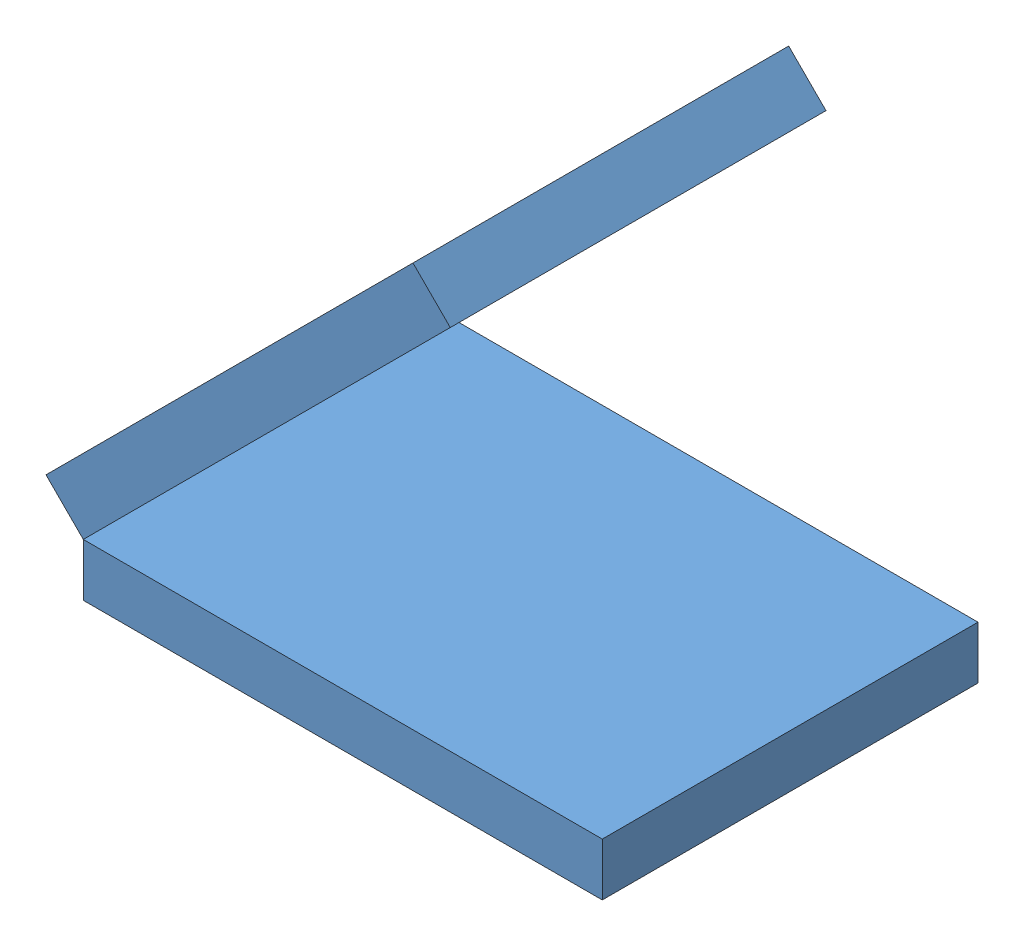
SolidWorks assembly Angle mate with reference entity.SLDASM, configuration Default (file format 11000). Lengths in mm.
Overall size (214.28 176.05 144.72).
2 component instances, 1 part files, 3 mates.
Components (placement in the parent):
- Plate-1: Plate.sldprt [Default] at origin size (199.91 20.32 144.72)
- Plate-2: Plate.sldprt [Default] at (-29.2768 91.0004 0) x (0.707107 0.707107 0) z (0 0 1) size (199.91 20.32 144.72)
Mates (geometry in assembly coordinates):
- Coincident1: coincident: line of assembly; line of assembly; line of Plate-1 through (-99.9572 20.32 72.3614) axis (0 0 -1); line of Plate-2 through (-99.9572 20.32 72.3614) axis (0 0 -1)
- Coincident3: coincident: plane of assembly; plane of assembly; plane of Plate-1 through (-99.9572 20.32 72.3614) normal (0 0 1); plane of Plate-2 through (-114.3257 34.6884 72.3614) normal (0 0 1)
- Angle3: planar angle = 0.785398 rad: plane of assembly; plane of assembly; line of assembly; plane of Plate-1 through (0 20.32 0) normal (0 1 0); plane of Plate-2 through (-29.2768 91.0004 0) normal (0.707107 -0.707107 0); line of Plate-1 through (-99.9572 20.32 72.3614) axis (0 0 -1)
